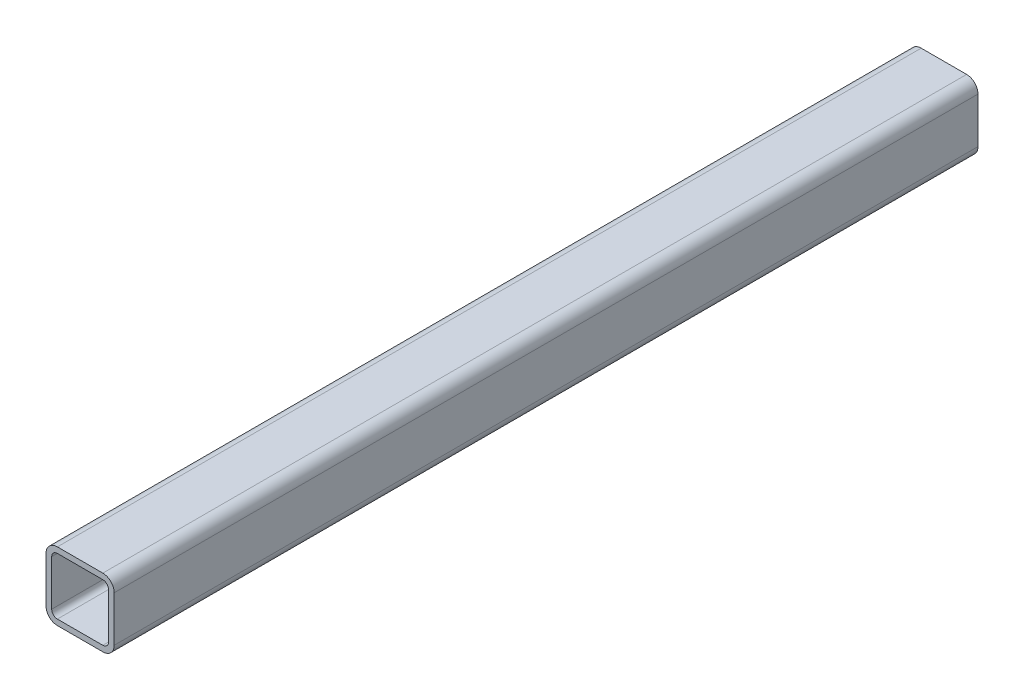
from build123d import *

# Parameters (mm, degrees)
EXTRUSION1_DEPTH = 760


with BuildPart() as part:
    # Sketch1 → Extrusion1 (new body)
    with BuildSketch(Plane.XY):
        with BuildLine():
            Line((-20, -30), (20, -30))
            ThreePointArc((20, -30), (27.071067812, -27.071067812), (30, -20))
            Line((30, -20), (30, 20))
            ThreePointArc((30, 20), (27.071067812, 27.071067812), (20, 30))
            Line((20, 30), (-20, 30))
            ThreePointArc((-20, 30), (-27.071067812, 27.071067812), (-30, 20))
            Line((-30, 20), (-30, -20))
            ThreePointArc((-30, -20), (-27.071067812, -27.071067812), (-20, -30))
        make_face()
        with BuildLine():
            Line((-20, -25), (20, -25))
            ThreePointArc((20, -25), (23.535533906, -23.535533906), (25, -20))
            Line((25, -20), (25, 20))
            ThreePointArc((25, 20), (23.535533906, 23.535533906), (20, 25))
            Line((20, 25), (-20, 25))
            ThreePointArc((-20, 25), (-23.535533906, 23.535533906), (-25, 20))
            Line((-25, 20), (-25, -20))
            ThreePointArc((-25, -20), (-23.535533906, -23.535533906), (-20, -25))
        make_face(mode=Mode.SUBTRACT)
    extrude(amount=EXTRUSION1_DEPTH)


solid = part.part
